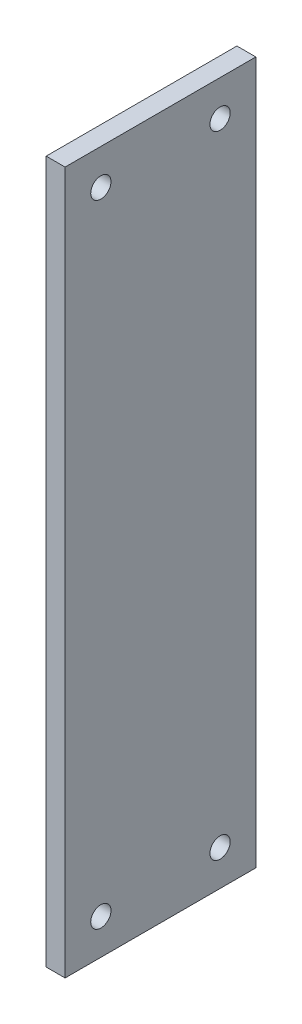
ISO-10303-21;
HEADER;
FILE_DESCRIPTION(('STEP AP214'),'2;1');
FILE_NAME('part.step','',(''),(''),'','','');
FILE_SCHEMA(('AUTOMOTIVE_DESIGN { 1 0 10303 214 1 1 1 1 }'));
ENDSEC;
DATA;
#1=APPLICATION_CONTEXT('core data for automotive mechanical design processes');
#2=APPLICATION_PROTOCOL_DEFINITION('international standard','automotive_design',2000,#1);
#3=PRODUCT_CONTEXT('',#1,'mechanical');
#4=PRODUCT('Part','Part','',(#3));
#5=PRODUCT_RELATED_PRODUCT_CATEGORY('part','',(#4));
#6=PRODUCT_DEFINITION_FORMATION('','',#4);
#7=PRODUCT_DEFINITION_CONTEXT('part definition',#1,'design');
#8=PRODUCT_DEFINITION('design','',#6,#7);
#9=PRODUCT_DEFINITION_SHAPE('','',#8);
#10=(LENGTH_UNIT() NAMED_UNIT(*) SI_UNIT(.MILLI.,.METRE.));
#11=(NAMED_UNIT(*) PLANE_ANGLE_UNIT() SI_UNIT($,.RADIAN.));
#12=(NAMED_UNIT(*) SI_UNIT($,.STERADIAN.) SOLID_ANGLE_UNIT());
#13=UNCERTAINTY_MEASURE_WITH_UNIT(LENGTH_MEASURE(1.E-05),#10,'distance_accuracy_value','');
#14=(GEOMETRIC_REPRESENTATION_CONTEXT(3) GLOBAL_UNCERTAINTY_ASSIGNED_CONTEXT((#13)) GLOBAL_UNIT_ASSIGNED_CONTEXT((#10,
#11,#12)) REPRESENTATION_CONTEXT('',''));
#15=CARTESIAN_POINT('',(0.,0.,0.));
#16=DIRECTION('',(0.,0.,1.));
#17=DIRECTION('',(1.,0.,0.));
#18=AXIS2_PLACEMENT_3D('',#15,#16,#17);
#19=CARTESIAN_POINT('',(-69.675,0.,0.));
#20=DIRECTION('',(1.,0.,0.));
#21=DIRECTION('',(0.,0.,-1.));
#22=AXIS2_PLACEMENT_3D('',#19,#20,#21);
#23=PLANE('',#22);
#24=CARTESIAN_POINT('',(-69.675,52.95125,136.875));
#25=DIRECTION('',(-1.,0.,0.));
#26=DIRECTION('',(0.,0.,1.));
#27=AXIS2_PLACEMENT_3D('',#24,#25,#26);
#28=CIRCLE('',#27,1.69999999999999);
#29=CARTESIAN_POINT('',(-69.675,52.95125,138.575));
#30=VERTEX_POINT('',#29);
#31=EDGE_CURVE('E130',#30,#30,#28,.T.);
#32=ORIENTED_EDGE('',*,*,#31,.F.);
#33=EDGE_LOOP('',(#32));
#34=FACE_BOUND('',#33,.T.);
#35=CARTESIAN_POINT('',(-69.675,52.95125,116.875));
#36=DIRECTION('',(-1.,0.,0.));
#37=DIRECTION('',(0.,0.,1.));
#38=AXIS2_PLACEMENT_3D('',#35,#36,#37);
#39=CIRCLE('',#38,1.69999999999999);
#40=CARTESIAN_POINT('',(-69.675,52.95125,118.575));
#41=VERTEX_POINT('',#40);
#42=EDGE_CURVE('E124',#41,#41,#39,.T.);
#43=ORIENTED_EDGE('',*,*,#42,.F.);
#44=EDGE_LOOP('',(#43));
#45=FACE_BOUND('',#44,.T.);
#46=CARTESIAN_POINT('',(-69.675,-52.95125,136.875));
#47=DIRECTION('',(-1.,0.,0.));
#48=DIRECTION('',(0.,0.,1.));
#49=AXIS2_PLACEMENT_3D('',#46,#47,#48);
#50=CIRCLE('',#49,1.69999999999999);
#51=CARTESIAN_POINT('',(-69.675,-52.95125,138.575));
#52=VERTEX_POINT('',#51);
#53=EDGE_CURVE('E118',#52,#52,#50,.T.);
#54=ORIENTED_EDGE('',*,*,#53,.F.);
#55=EDGE_LOOP('',(#54));
#56=FACE_BOUND('',#55,.T.);
#57=DIRECTION('',(0.,1.,0.));
#58=VECTOR('',#57,1.);
#59=CARTESIAN_POINT('',(-69.675,58.9125,142.875));
#60=LINE('',#59,#58);
#61=CARTESIAN_POINT('',(-69.675,-58.9125,142.875));
#62=VERTEX_POINT('',#61);
#63=CARTESIAN_POINT('',(-69.675,58.9125,142.875));
#64=VERTEX_POINT('',#63);
#65=EDGE_CURVE('E84',#62,#64,#60,.T.);
#66=ORIENTED_EDGE('',*,*,#65,.T.);
#67=DIRECTION('',(0.,0.,-1.));
#68=VECTOR('',#67,1.);
#69=CARTESIAN_POINT('',(-69.675,58.9125,142.875));
#70=LINE('',#69,#68);
#71=CARTESIAN_POINT('',(-69.675,58.9125,110.875));
#72=VERTEX_POINT('',#71);
#73=EDGE_CURVE('E79',#64,#72,#70,.T.);
#74=ORIENTED_EDGE('',*,*,#73,.T.);
#75=DIRECTION('',(0.,-1.,0.));
#76=VECTOR('',#75,1.);
#77=CARTESIAN_POINT('',(-69.675,58.9125,110.875));
#78=LINE('',#77,#76);
#79=CARTESIAN_POINT('',(-69.675,-58.9125,110.875));
#80=VERTEX_POINT('',#79);
#81=EDGE_CURVE('E82',#72,#80,#78,.T.);
#82=ORIENTED_EDGE('',*,*,#81,.T.);
#83=DIRECTION('',(0.,0.,1.));
#84=VECTOR('',#83,1.);
#85=CARTESIAN_POINT('',(-69.675,-58.9125,142.875));
#86=LINE('',#85,#84);
#87=EDGE_CURVE('E49',#80,#62,#86,.T.);
#88=ORIENTED_EDGE('',*,*,#87,.T.);
#89=EDGE_LOOP('',(#66,#74,#82,#88));
#90=FACE_BOUND('',#89,.T.);
#91=CARTESIAN_POINT('',(-69.675,-52.95125,116.875));
#92=DIRECTION('',(-1.,0.,0.));
#93=DIRECTION('',(0.,0.,1.));
#94=AXIS2_PLACEMENT_3D('',#91,#92,#93);
#95=CIRCLE('',#94,1.69999999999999);
#96=CARTESIAN_POINT('',(-69.675,-52.95125,118.575));
#97=VERTEX_POINT('',#96);
#98=EDGE_CURVE('E112',#97,#97,#95,.T.);
#99=ORIENTED_EDGE('',*,*,#98,.F.);
#100=EDGE_LOOP('',(#99));
#101=FACE_BOUND('',#100,.T.);
#102=ADVANCED_FACE('F32',(#34,#45,#56,#90,#101),#23,.F.);
#103=CARTESIAN_POINT('',(-69.675,58.9125,142.875));
#104=DIRECTION('',(0.,0.,-1.));
#105=DIRECTION('',(0.,1.,0.));
#106=AXIS2_PLACEMENT_3D('',#103,#104,#105);
#107=PLANE('',#106);
#108=DIRECTION('',(0.,1.,0.));
#109=VECTOR('',#108,1.);
#110=CARTESIAN_POINT('',(-66.5,58.9125,142.875));
#111=LINE('',#110,#109);
#112=CARTESIAN_POINT('',(-66.5,-58.9125,142.875));
#113=VERTEX_POINT('',#112);
#114=CARTESIAN_POINT('',(-66.5,58.9125,142.875));
#115=VERTEX_POINT('',#114);
#116=EDGE_CURVE('E96',#113,#115,#111,.T.);
#117=ORIENTED_EDGE('',*,*,#116,.T.);
#118=DIRECTION('',(1.,0.,0.));
#119=VECTOR('',#118,1.);
#120=CARTESIAN_POINT('',(-69.675,58.9125,142.875));
#121=LINE('',#120,#119);
#122=EDGE_CURVE('E11',#64,#115,#121,.T.);
#123=ORIENTED_EDGE('',*,*,#122,.F.);
#124=ORIENTED_EDGE('',*,*,#65,.F.);
#125=DIRECTION('',(1.,0.,0.));
#126=VECTOR('',#125,1.);
#127=CARTESIAN_POINT('',(-69.675,-58.9125,142.875));
#128=LINE('',#127,#126);
#129=EDGE_CURVE('E92',#62,#113,#128,.T.);
#130=ORIENTED_EDGE('',*,*,#129,.T.);
#131=EDGE_LOOP('',(#117,#123,#124,#130));
#132=FACE_BOUND('',#131,.T.);
#133=ADVANCED_FACE('F34',(#132),#107,.F.);
#134=CARTESIAN_POINT('',(-69.675,58.9125,142.875));
#135=DIRECTION('',(0.,-1.,0.));
#136=DIRECTION('',(0.,0.,-1.));
#137=AXIS2_PLACEMENT_3D('',#134,#135,#136);
#138=PLANE('',#137);
#139=DIRECTION('',(0.,0.,-1.));
#140=VECTOR('',#139,1.);
#141=CARTESIAN_POINT('',(-66.5,58.9125,142.875));
#142=LINE('',#141,#140);
#143=CARTESIAN_POINT('',(-66.5,58.9125,110.875));
#144=VERTEX_POINT('',#143);
#145=EDGE_CURVE('E88',#115,#144,#142,.T.);
#146=ORIENTED_EDGE('',*,*,#145,.T.);
#147=DIRECTION('',(1.,0.,0.));
#148=VECTOR('',#147,1.);
#149=CARTESIAN_POINT('',(-69.675,58.9125,110.875));
#150=LINE('',#149,#148);
#151=EDGE_CURVE('E41',#72,#144,#150,.T.);
#152=ORIENTED_EDGE('',*,*,#151,.F.);
#153=ORIENTED_EDGE('',*,*,#73,.F.);
#154=ORIENTED_EDGE('',*,*,#122,.T.);
#155=EDGE_LOOP('',(#146,#152,#153,#154));
#156=FACE_BOUND('',#155,.T.);
#157=ADVANCED_FACE('F87',(#156),#138,.F.);
#158=CARTESIAN_POINT('',(-69.675,58.9125,110.875));
#159=DIRECTION('',(0.,0.,1.));
#160=DIRECTION('',(0.,-1.,0.));
#161=AXIS2_PLACEMENT_3D('',#158,#159,#160);
#162=PLANE('',#161);
#163=DIRECTION('',(0.,-1.,0.));
#164=VECTOR('',#163,1.);
#165=CARTESIAN_POINT('',(-66.5,58.9125,110.875));
#166=LINE('',#165,#164);
#167=CARTESIAN_POINT('',(-66.5,-58.9125,110.875));
#168=VERTEX_POINT('',#167);
#169=EDGE_CURVE('E66',#144,#168,#166,.T.);
#170=ORIENTED_EDGE('',*,*,#169,.T.);
#171=DIRECTION('',(1.,0.,0.));
#172=VECTOR('',#171,1.);
#173=CARTESIAN_POINT('',(-69.675,-58.9125,110.875));
#174=LINE('',#173,#172);
#175=EDGE_CURVE('E89',#80,#168,#174,.T.);
#176=ORIENTED_EDGE('',*,*,#175,.F.);
#177=ORIENTED_EDGE('',*,*,#81,.F.);
#178=ORIENTED_EDGE('',*,*,#151,.T.);
#179=EDGE_LOOP('',(#170,#176,#177,#178));
#180=FACE_BOUND('',#179,.T.);
#181=ADVANCED_FACE('F90',(#180),#162,.F.);
#182=CARTESIAN_POINT('',(-69.675,-58.9125,142.875));
#183=DIRECTION('',(0.,1.,0.));
#184=DIRECTION('',(0.,0.,1.));
#185=AXIS2_PLACEMENT_3D('',#182,#183,#184);
#186=PLANE('',#185);
#187=DIRECTION('',(0.,0.,1.));
#188=VECTOR('',#187,1.);
#189=CARTESIAN_POINT('',(-66.5,-58.9125,142.875));
#190=LINE('',#189,#188);
#191=EDGE_CURVE('E72',#168,#113,#190,.T.);
#192=ORIENTED_EDGE('',*,*,#191,.T.);
#193=ORIENTED_EDGE('',*,*,#129,.F.);
#194=ORIENTED_EDGE('',*,*,#87,.F.);
#195=ORIENTED_EDGE('',*,*,#175,.T.);
#196=EDGE_LOOP('',(#192,#193,#194,#195));
#197=FACE_BOUND('',#196,.T.);
#198=ADVANCED_FACE('F104',(#197),#186,.F.);
#199=CARTESIAN_POINT('',(-66.5,0.,0.));
#200=DIRECTION('',(1.,0.,0.));
#201=DIRECTION('',(0.,0.,-1.));
#202=AXIS2_PLACEMENT_3D('',#199,#200,#201);
#203=PLANE('',#202);
#204=CARTESIAN_POINT('',(-66.5,52.95125,136.875));
#205=DIRECTION('',(1.,0.,0.));
#206=DIRECTION('',(0.,0.,-1.));
#207=AXIS2_PLACEMENT_3D('',#204,#205,#206);
#208=CIRCLE('',#207,1.69999999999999);
#209=CARTESIAN_POINT('',(-66.5,52.95125,135.175));
#210=VERTEX_POINT('',#209);
#211=EDGE_CURVE('E127',#210,#210,#208,.T.);
#212=ORIENTED_EDGE('',*,*,#211,.F.);
#213=EDGE_LOOP('',(#212));
#214=FACE_BOUND('',#213,.T.);
#215=CARTESIAN_POINT('',(-66.5,52.95125,116.875));
#216=DIRECTION('',(1.,0.,0.));
#217=DIRECTION('',(0.,0.,-1.));
#218=AXIS2_PLACEMENT_3D('',#215,#216,#217);
#219=CIRCLE('',#218,1.69999999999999);
#220=CARTESIAN_POINT('',(-66.5,52.95125,115.175));
#221=VERTEX_POINT('',#220);
#222=EDGE_CURVE('E121',#221,#221,#219,.T.);
#223=ORIENTED_EDGE('',*,*,#222,.F.);
#224=EDGE_LOOP('',(#223));
#225=FACE_BOUND('',#224,.T.);
#226=CARTESIAN_POINT('',(-66.5,-52.95125,136.875));
#227=DIRECTION('',(1.,0.,0.));
#228=DIRECTION('',(0.,0.,-1.));
#229=AXIS2_PLACEMENT_3D('',#226,#227,#228);
#230=CIRCLE('',#229,1.69999999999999);
#231=CARTESIAN_POINT('',(-66.5,-52.95125,135.175));
#232=VERTEX_POINT('',#231);
#233=EDGE_CURVE('E115',#232,#232,#230,.T.);
#234=ORIENTED_EDGE('',*,*,#233,.F.);
#235=EDGE_LOOP('',(#234));
#236=FACE_BOUND('',#235,.T.);
#237=CARTESIAN_POINT('',(-66.5,-52.95125,116.875));
#238=DIRECTION('',(1.,0.,0.));
#239=DIRECTION('',(0.,0.,-1.));
#240=AXIS2_PLACEMENT_3D('',#237,#238,#239);
#241=CIRCLE('',#240,1.69999999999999);
#242=CARTESIAN_POINT('',(-66.5,-52.95125,115.175));
#243=VERTEX_POINT('',#242);
#244=EDGE_CURVE('E99',#243,#243,#241,.T.);
#245=ORIENTED_EDGE('',*,*,#244,.F.);
#246=EDGE_LOOP('',(#245));
#247=FACE_BOUND('',#246,.T.);
#248=ORIENTED_EDGE('',*,*,#116,.F.);
#249=ORIENTED_EDGE('',*,*,#191,.F.);
#250=ORIENTED_EDGE('',*,*,#169,.F.);
#251=ORIENTED_EDGE('',*,*,#145,.F.);
#252=EDGE_LOOP('',(#248,#249,#250,#251));
#253=FACE_BOUND('',#252,.T.);
#254=ADVANCED_FACE('F107',(#214,#225,#236,#247,#253),#203,.T.);
#255=CARTESIAN_POINT('',(-69.675,-52.95125,116.875));
#256=DIRECTION('',(-1.,0.,0.));
#257=DIRECTION('',(0.,0.,1.));
#258=AXIS2_PLACEMENT_3D('',#255,#256,#257);
#259=CYLINDRICAL_SURFACE('',#258,1.69999999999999);
#260=ORIENTED_EDGE('',*,*,#244,.T.);
#261=EDGE_LOOP('',(#260));
#262=FACE_BOUND('',#261,.T.);
#263=ORIENTED_EDGE('',*,*,#98,.T.);
#264=EDGE_LOOP('',(#263));
#265=FACE_BOUND('',#264,.T.);
#266=ADVANCED_FACE('F146',(#262,#265),#259,.F.);
#267=CARTESIAN_POINT('',(-69.675,-52.95125,136.875));
#268=DIRECTION('',(-1.,0.,0.));
#269=DIRECTION('',(0.,0.,1.));
#270=AXIS2_PLACEMENT_3D('',#267,#268,#269);
#271=CYLINDRICAL_SURFACE('',#270,1.69999999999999);
#272=ORIENTED_EDGE('',*,*,#233,.T.);
#273=EDGE_LOOP('',(#272));
#274=FACE_BOUND('',#273,.T.);
#275=ORIENTED_EDGE('',*,*,#53,.T.);
#276=EDGE_LOOP('',(#275));
#277=FACE_BOUND('',#276,.T.);
#278=ADVANCED_FACE('F143',(#274,#277),#271,.F.);
#279=CARTESIAN_POINT('',(-69.675,52.95125,116.875));
#280=DIRECTION('',(-1.,0.,0.));
#281=DIRECTION('',(0.,0.,1.));
#282=AXIS2_PLACEMENT_3D('',#279,#280,#281);
#283=CYLINDRICAL_SURFACE('',#282,1.69999999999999);
#284=ORIENTED_EDGE('',*,*,#222,.T.);
#285=EDGE_LOOP('',(#284));
#286=FACE_BOUND('',#285,.T.);
#287=ORIENTED_EDGE('',*,*,#42,.T.);
#288=EDGE_LOOP('',(#287));
#289=FACE_BOUND('',#288,.T.);
#290=ADVANCED_FACE('F145',(#286,#289),#283,.F.);
#291=CARTESIAN_POINT('',(-69.675,52.95125,136.875));
#292=DIRECTION('',(-1.,0.,0.));
#293=DIRECTION('',(0.,0.,1.));
#294=AXIS2_PLACEMENT_3D('',#291,#292,#293);
#295=CYLINDRICAL_SURFACE('',#294,1.69999999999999);
#296=ORIENTED_EDGE('',*,*,#211,.T.);
#297=EDGE_LOOP('',(#296));
#298=FACE_BOUND('',#297,.T.);
#299=ORIENTED_EDGE('',*,*,#31,.T.);
#300=EDGE_LOOP('',(#299));
#301=FACE_BOUND('',#300,.T.);
#302=ADVANCED_FACE('F134',(#298,#301),#295,.F.);
#303=CLOSED_SHELL('',(#102,#133,#157,#181,#198,#254,#266,#278,#290,#302));
#304=MANIFOLD_SOLID_BREP('B2',#303);
#305=ADVANCED_BREP_SHAPE_REPRESENTATION('',(#18,#304),#14);
#306=SHAPE_DEFINITION_REPRESENTATION(#9,#305);
ENDSEC;
END-ISO-10303-21;
